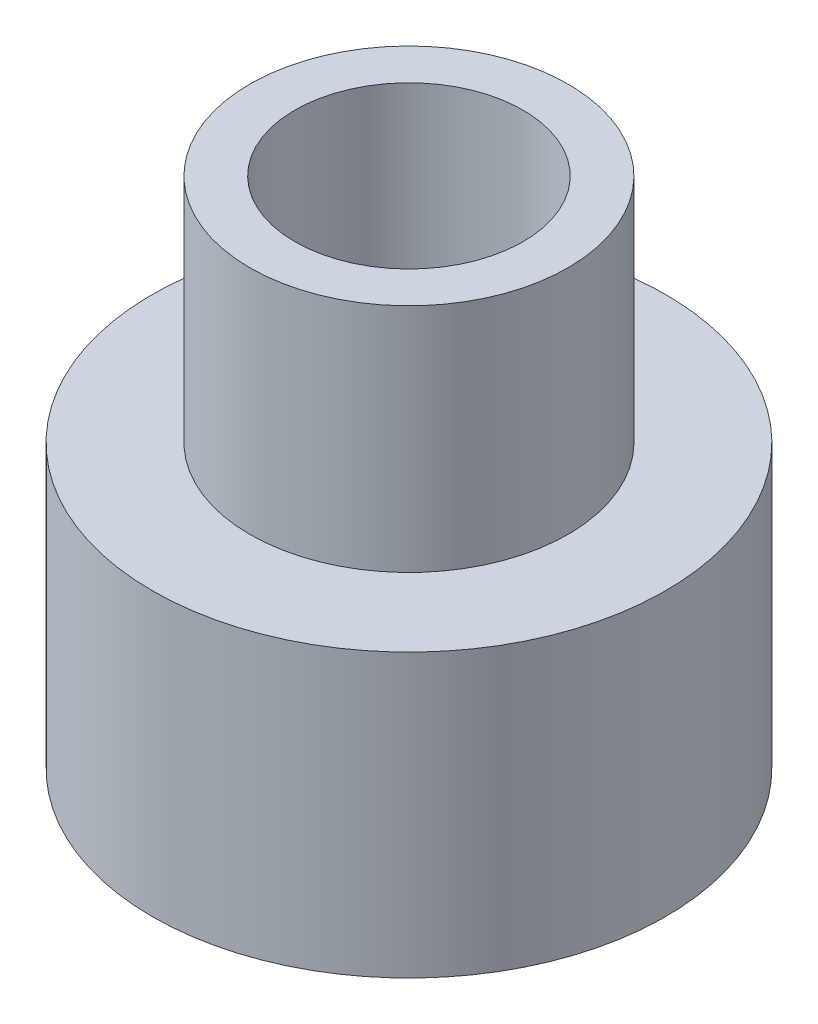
from build123d import *

# Parameters (mm, degrees)
SKETCH3_R                 = 2
BOSS_EXTRUDE2_DEPTH       = 2.2
SKETCH4_R                 = 1.24
BOSS_EXTRUDE3_DEPTH       = 1.8
F_2_56_TAPPED_HOLE1_D     = 1.778
F_2_56_TAPPED_HOLE1_DEPTH = 3.175
F_2_56_TAPPED_HOLE1_TIP   = 0.53416509


with BuildPart() as part:
    # Sketch3 → Boss-Extrude2 (new body)
    with BuildSketch(Plane(origin=(0, 0, 0), x_dir=(1, 0, 0), z_dir=(0, 1, 0))):
        with Locations(Location((0, 0, 0), (0, 0, 270))):
            Circle(SKETCH3_R)
    extrude(amount=BOSS_EXTRUDE2_DEPTH)

    # Sketch4 → Boss-Extrude3 (add)
    with BuildSketch(Plane(origin=(0, 2.2, 0), x_dir=(1, 0, 0), z_dir=(0, 1, 0))):
        with Locations(Location((0, 0, 0), (0, 0, 270))):
            Circle(SKETCH4_R)
    extrude(amount=BOSS_EXTRUDE3_DEPTH)

    # 2-56 Tapped Hole1
    with Locations(Plane(origin=(0, 4, 0), x_dir=(1, 0, 0), z_dir=(0, 1, 0))):
        with Locations((0, 0)):
            Hole(F_2_56_TAPPED_HOLE1_D / 2, depth=F_2_56_TAPPED_HOLE1_DEPTH)
            with Locations((0, 0, -(F_2_56_TAPPED_HOLE1_DEPTH + F_2_56_TAPPED_HOLE1_TIP / 2))):  # 118° drill point
                Cone(0, F_2_56_TAPPED_HOLE1_D / 2, F_2_56_TAPPED_HOLE1_TIP, mode=Mode.SUBTRACT)


solid = part.part
